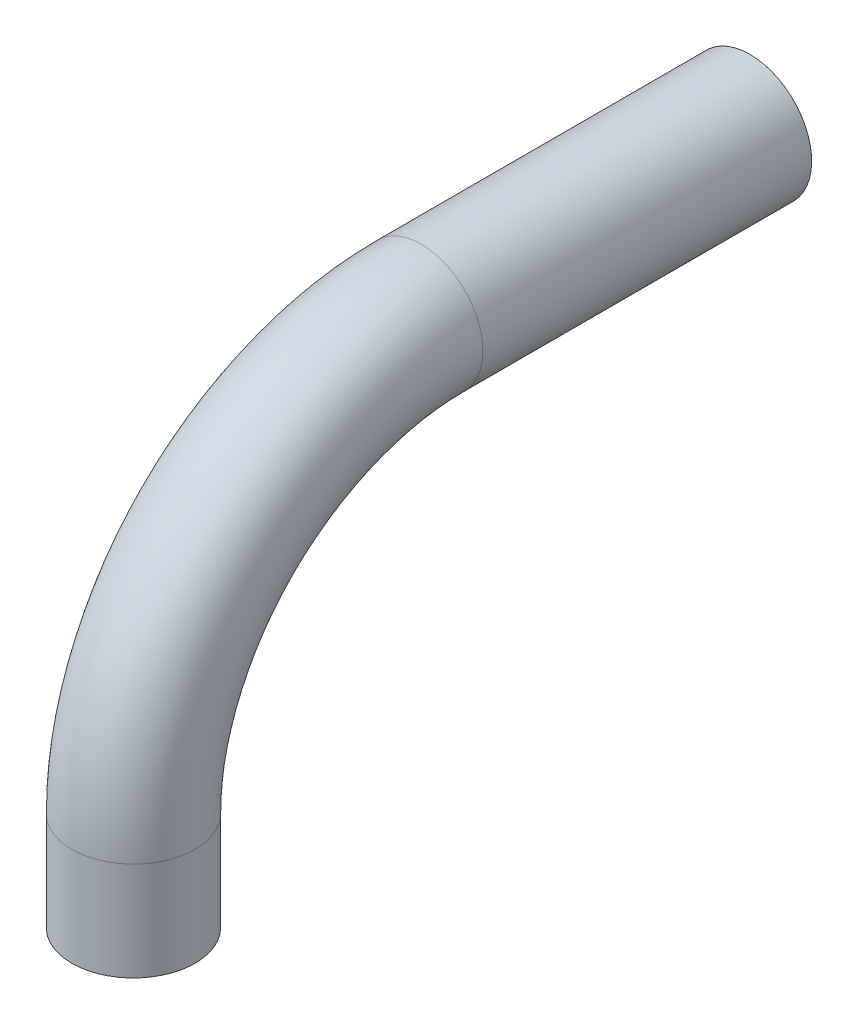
from build123d import *

# Parameters (mm, degrees)
SKETCH1_R   = 2.38125
SKETCH1_R_2 = 1.778


with BuildPart() as part:
    # Sweep1: sweep along a path in Sketch2
    with BuildLine(Plane(origin=(0, 0, 0), x_dir=(0, 0, -1), z_dir=(1, 0, 0))) as sweep1_path:
        Line((0, 0), (0, 3.81))
        ThreePointArc((0, 3.81), (3.254775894, 11.667724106), (11.1125, 14.9225))
        Line((11.1125, 14.9225), (23.8125, 14.9225))
    # Sketch1 → Sweep1 (sweep)
    with BuildSketch(Plane(origin=(0, 0, 0), x_dir=(1, 0, 0), z_dir=(0, 1, 0))):
        Circle(SKETCH1_R)
        Circle(SKETCH1_R_2, mode=Mode.SUBTRACT)
    sweep(path=sweep1_path.line)


solid = part.part
